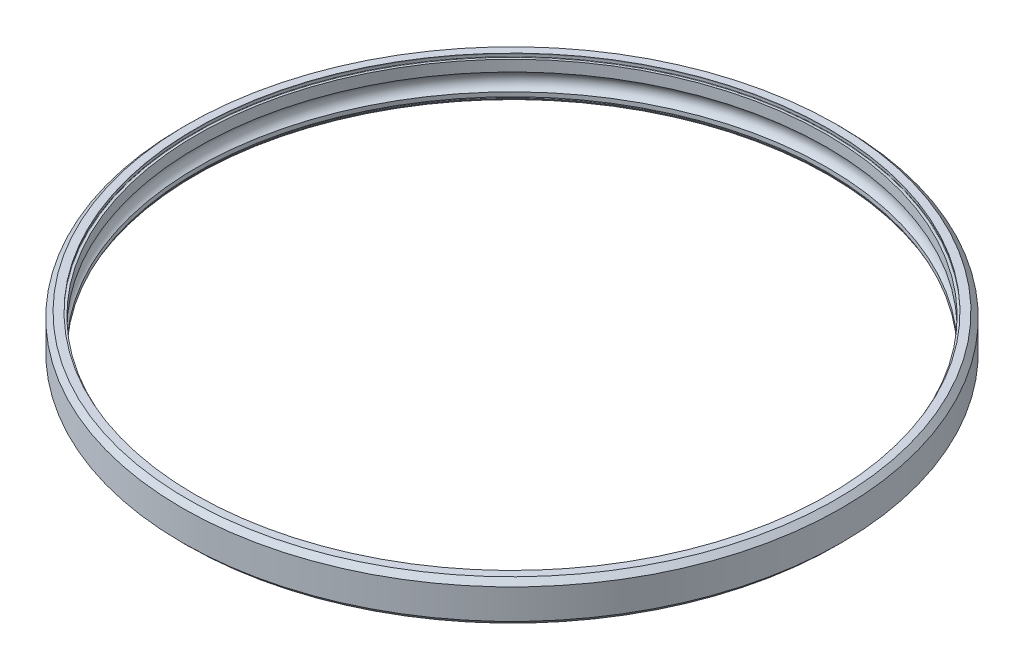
ISO-10303-21;
HEADER;
FILE_DESCRIPTION(('STEP AP214'),'2;1');
FILE_NAME('part.step','',(''),(''),'','','');
FILE_SCHEMA(('AUTOMOTIVE_DESIGN { 1 0 10303 214 1 1 1 1 }'));
ENDSEC;
DATA;
#1=APPLICATION_CONTEXT('core data for automotive mechanical design processes');
#2=APPLICATION_PROTOCOL_DEFINITION('international standard','automotive_design',2000,#1);
#3=PRODUCT_CONTEXT('',#1,'mechanical');
#4=PRODUCT('Part','Part','',(#3));
#5=PRODUCT_RELATED_PRODUCT_CATEGORY('part','',(#4));
#6=PRODUCT_DEFINITION_FORMATION('','',#4);
#7=PRODUCT_DEFINITION_CONTEXT('part definition',#1,'design');
#8=PRODUCT_DEFINITION('design','',#6,#7);
#9=PRODUCT_DEFINITION_SHAPE('','',#8);
#10=(LENGTH_UNIT() NAMED_UNIT(*) SI_UNIT(.MILLI.,.METRE.));
#11=(NAMED_UNIT(*) PLANE_ANGLE_UNIT() SI_UNIT($,.RADIAN.));
#12=(NAMED_UNIT(*) SI_UNIT($,.STERADIAN.) SOLID_ANGLE_UNIT());
#13=UNCERTAINTY_MEASURE_WITH_UNIT(LENGTH_MEASURE(1.E-05),#10,'distance_accuracy_value','');
#14=(GEOMETRIC_REPRESENTATION_CONTEXT(3) GLOBAL_UNCERTAINTY_ASSIGNED_CONTEXT((#13)) GLOBAL_UNIT_ASSIGNED_CONTEXT((#10,
#11,#12)) REPRESENTATION_CONTEXT('',''));
#15=CARTESIAN_POINT('',(0.,0.,0.));
#16=DIRECTION('',(0.,0.,1.));
#17=DIRECTION('',(1.,0.,0.));
#18=AXIS2_PLACEMENT_3D('',#15,#16,#17);
#19=CARTESIAN_POINT('',(0.,0.,0.));
#20=DIRECTION('',(0.,-1.,0.));
#21=DIRECTION('',(0.,0.,-1.));
#22=AXIS2_PLACEMENT_3D('',#19,#20,#21);
#23=CYLINDRICAL_SURFACE('',#22,62.1411);
#24=CARTESIAN_POINT('',(0.,-1.70000731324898,0.));
#25=DIRECTION('',(0.,-1.,0.));
#26=DIRECTION('',(0.,0.,-1.));
#27=AXIS2_PLACEMENT_3D('',#24,#25,#26);
#28=CIRCLE('',#27,62.1411);
#29=CARTESIAN_POINT('',(0.,-1.70000731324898,-62.1411));
#30=VERTEX_POINT('',#29);
#31=EDGE_CURVE('E48',#30,#30,#28,.T.);
#32=ORIENTED_EDGE('',*,*,#31,.F.);
#33=EDGE_LOOP('',(#32));
#34=FACE_BOUND('',#33,.T.);
#35=CARTESIAN_POINT('',(0.,-2.53237999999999,0.));
#36=DIRECTION('',(0.,-1.,0.));
#37=DIRECTION('',(0.,0.,-1.));
#38=AXIS2_PLACEMENT_3D('',#35,#36,#37);
#39=CIRCLE('',#38,62.1411);
#40=CARTESIAN_POINT('',(0.,-2.53237999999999,-62.1411));
#41=VERTEX_POINT('',#40);
#42=EDGE_CURVE('E75',#41,#41,#39,.T.);
#43=ORIENTED_EDGE('',*,*,#42,.T.);
#44=EDGE_LOOP('',(#43));
#45=FACE_BOUND('',#44,.T.);
#46=ADVANCED_FACE('F28',(#34,#45),#23,.F.);
#47=CARTESIAN_POINT('',(-62.1411,-3.29438000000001,0.));
#48=DIRECTION('',(0.,1.,0.));
#49=DIRECTION('',(0.,0.,1.));
#50=AXIS2_PLACEMENT_3D('',#47,#48,#49);
#51=PLANE('',#50);
#52=CARTESIAN_POINT('',(0.,-3.29438000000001,0.));
#53=DIRECTION('',(0.,1.,0.));
#54=DIRECTION('',(0.,0.,1.));
#55=AXIS2_PLACEMENT_3D('',#52,#53,#54);
#56=CIRCLE('',#55,64.0715);
#57=CARTESIAN_POINT('',(0.,-3.29438000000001,64.0715));
#58=VERTEX_POINT('',#57);
#59=EDGE_CURVE('E10',#58,#58,#56,.F.);
#60=ORIENTED_EDGE('',*,*,#59,.T.);
#61=EDGE_LOOP('',(#60));
#62=FACE_BOUND('',#61,.T.);
#63=CARTESIAN_POINT('',(0.,-3.29437999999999,0.));
#64=DIRECTION('',(0.,-1.,0.));
#65=DIRECTION('',(0.,0.,-1.));
#66=AXIS2_PLACEMENT_3D('',#63,#64,#65);
#67=CIRCLE('',#66,62.54115);
#68=CARTESIAN_POINT('',(0.,-3.29437999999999,-62.54115));
#69=VERTEX_POINT('',#68);
#70=EDGE_CURVE('E93',#69,#69,#67,.T.);
#71=ORIENTED_EDGE('',*,*,#70,.F.);
#72=EDGE_LOOP('',(#71));
#73=FACE_BOUND('',#72,.T.);
#74=ADVANCED_FACE('F99',(#62,#73),#51,.F.);
#75=CARTESIAN_POINT('',(0.,1.70000731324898,0.));
#76=DIRECTION('',(0.,-1.,0.));
#77=DIRECTION('',(0.,0.,-1.));
#78=AXIS2_PLACEMENT_3D('',#75,#76,#77);
#79=CIRCLE('',#78,62.1411);
#80=CARTESIAN_POINT('',(0.,1.70000731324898,-62.1411));
#81=VERTEX_POINT('',#80);
#82=EDGE_CURVE('E51',#81,#81,#79,.T.);
#83=ORIENTED_EDGE('',*,*,#82,.T.);
#84=EDGE_LOOP('',(#83));
#85=FACE_BOUND('',#84,.T.);
#86=CARTESIAN_POINT('',(0.,3.88111999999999,0.));
#87=DIRECTION('',(0.,-1.,0.));
#88=DIRECTION('',(0.,0.,-1.));
#89=AXIS2_PLACEMENT_3D('',#86,#87,#88);
#90=CIRCLE('',#89,62.1411);
#91=CARTESIAN_POINT('',(0.,3.88111999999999,-62.1411));
#92=VERTEX_POINT('',#91);
#93=EDGE_CURVE('E54',#92,#92,#90,.T.);
#94=ORIENTED_EDGE('',*,*,#93,.F.);
#95=EDGE_LOOP('',(#94));
#96=FACE_BOUND('',#95,.T.);
#97=ADVANCED_FACE('F101',(#85,#96),#23,.F.);
#98=CARTESIAN_POINT('',(-62.1411,4.64311999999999,0.));
#99=DIRECTION('',(0.,-1.,0.));
#100=DIRECTION('',(0.,0.,-1.));
#101=AXIS2_PLACEMENT_3D('',#98,#99,#100);
#102=PLANE('',#101);
#103=CARTESIAN_POINT('',(0.,4.64311999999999,0.));
#104=DIRECTION('',(0.,-1.,0.));
#105=DIRECTION('',(0.,0.,-1.));
#106=AXIS2_PLACEMENT_3D('',#103,#104,#105);
#107=CIRCLE('',#106,64.0715);
#108=CARTESIAN_POINT('',(0.,4.64311999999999,-64.0715));
#109=VERTEX_POINT('',#108);
#110=EDGE_CURVE('E35',#109,#109,#107,.F.);
#111=ORIENTED_EDGE('',*,*,#110,.T.);
#112=EDGE_LOOP('',(#111));
#113=FACE_BOUND('',#112,.T.);
#114=CARTESIAN_POINT('',(0.,4.64311999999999,0.));
#115=DIRECTION('',(0.,-1.,0.));
#116=DIRECTION('',(0.,0.,-1.));
#117=AXIS2_PLACEMENT_3D('',#114,#115,#116);
#118=CIRCLE('',#117,62.54115);
#119=CARTESIAN_POINT('',(0.,4.64311999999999,-62.54115));
#120=VERTEX_POINT('',#119);
#121=EDGE_CURVE('E72',#120,#120,#118,.T.);
#122=ORIENTED_EDGE('',*,*,#121,.T.);
#123=EDGE_LOOP('',(#122));
#124=FACE_BOUND('',#123,.T.);
#125=ADVANCED_FACE('F106',(#113,#124),#102,.F.);
#126=CARTESIAN_POINT('',(0.,0.,0.));
#127=DIRECTION('',(0.,-1.,0.));
#128=DIRECTION('',(0.,0.,-1.));
#129=AXIS2_PLACEMENT_3D('',#126,#127,#128);
#130=CYLINDRICAL_SURFACE('',#129,65.0875);
#131=CARTESIAN_POINT('',(0.,3.62711999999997,0.));
#132=DIRECTION('',(0.,-1.,0.));
#133=DIRECTION('',(0.,0.,-1.));
#134=AXIS2_PLACEMENT_3D('',#131,#132,#133);
#135=CIRCLE('',#134,65.0875);
#136=CARTESIAN_POINT('',(0.,3.62711999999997,-65.0875));
#137=VERTEX_POINT('',#136);
#138=EDGE_CURVE('E39',#137,#137,#135,.T.);
#139=ORIENTED_EDGE('',*,*,#138,.T.);
#140=EDGE_LOOP('',(#139));
#141=FACE_BOUND('',#140,.T.);
#142=CARTESIAN_POINT('',(0.,-2.27838000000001,0.));
#143=DIRECTION('',(0.,1.,0.));
#144=DIRECTION('',(0.,0.,1.));
#145=AXIS2_PLACEMENT_3D('',#142,#143,#144);
#146=CIRCLE('',#145,65.0875);
#147=CARTESIAN_POINT('',(0.,-2.27838000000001,65.0875));
#148=VERTEX_POINT('',#147);
#149=EDGE_CURVE('E43',#148,#148,#146,.T.);
#150=ORIENTED_EDGE('',*,*,#149,.T.);
#151=EDGE_LOOP('',(#150));
#152=FACE_BOUND('',#151,.T.);
#153=ADVANCED_FACE('F30',(#141,#152),#130,.T.);
#154=CARTESIAN_POINT('',(0.,0.,0.));
#155=DIRECTION('',(0.,-1.,0.));
#156=DIRECTION('',(0.,0.,-1.));
#157=AXIS2_PLACEMENT_3D('',#154,#155,#156);
#158=TOROIDAL_SURFACE('',#157,61.11875,1.98374000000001);
#159=ORIENTED_EDGE('',*,*,#31,.T.);
#160=EDGE_LOOP('',(#159));
#161=FACE_BOUND('',#160,.T.);
#162=ORIENTED_EDGE('',*,*,#82,.F.);
#163=EDGE_LOOP('',(#162));
#164=FACE_BOUND('',#163,.T.);
#165=ADVANCED_FACE('F113',(#161,#164),#158,.F.);
#166=CARTESIAN_POINT('',(0.,3.62711999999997,0.));
#167=DIRECTION('',(0.,-1.,0.));
#168=DIRECTION('',(0.,0.,-1.));
#169=AXIS2_PLACEMENT_3D('',#166,#167,#168);
#170=CONICAL_SURFACE('',#169,65.0875,0.785398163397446);
#171=ORIENTED_EDGE('',*,*,#110,.F.);
#172=EDGE_LOOP('',(#171));
#173=FACE_BOUND('',#172,.T.);
#174=ORIENTED_EDGE('',*,*,#138,.F.);
#175=EDGE_LOOP('',(#174));
#176=FACE_BOUND('',#175,.T.);
#177=ADVANCED_FACE('F116',(#173,#176),#170,.T.);
#178=CARTESIAN_POINT('',(0.,-3.29438000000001,0.));
#179=DIRECTION('',(0.,1.,0.));
#180=DIRECTION('',(0.,0.,1.));
#181=AXIS2_PLACEMENT_3D('',#178,#179,#180);
#182=CONICAL_SURFACE('',#181,64.0715,0.785398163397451);
#183=ORIENTED_EDGE('',*,*,#149,.F.);
#184=EDGE_LOOP('',(#183));
#185=FACE_BOUND('',#184,.T.);
#186=ORIENTED_EDGE('',*,*,#59,.F.);
#187=EDGE_LOOP('',(#186));
#188=FACE_BOUND('',#187,.T.);
#189=ADVANCED_FACE('F120',(#185,#188),#182,.T.);
#190=CARTESIAN_POINT('',(-62.1411,3.88111999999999,0.));
#191=DIRECTION('',(0.,1.,0.));
#192=DIRECTION('',(0.,0.,1.));
#193=AXIS2_PLACEMENT_3D('',#190,#191,#192);
#194=PLANE('',#193);
#195=ORIENTED_EDGE('',*,*,#93,.T.);
#196=EDGE_LOOP('',(#195));
#197=FACE_BOUND('',#196,.T.);
#198=CARTESIAN_POINT('',(0.,3.88111999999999,0.));
#199=DIRECTION('',(0.,-1.,0.));
#200=DIRECTION('',(0.,0.,-1.));
#201=AXIS2_PLACEMENT_3D('',#198,#199,#200);
#202=CIRCLE('',#201,62.5983);
#203=CARTESIAN_POINT('',(0.,3.88111999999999,-62.5983));
#204=VERTEX_POINT('',#203);
#205=EDGE_CURVE('E57',#204,#204,#202,.T.);
#206=ORIENTED_EDGE('',*,*,#205,.F.);
#207=EDGE_LOOP('',(#206));
#208=FACE_BOUND('',#207,.T.);
#209=ADVANCED_FACE('F124',(#197,#208),#194,.T.);
#210=CARTESIAN_POINT('',(0.,3.95731999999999,0.));
#211=DIRECTION('',(0.,-1.,0.));
#212=DIRECTION('',(0.,0.,-1.));
#213=AXIS2_PLACEMENT_3D('',#210,#211,#212);
#214=TOROIDAL_SURFACE('',#213,62.5983,0.0761999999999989);
#215=ORIENTED_EDGE('',*,*,#205,.T.);
#216=EDGE_LOOP('',(#215));
#217=FACE_BOUND('',#216,.T.);
#218=CARTESIAN_POINT('',(0.,3.95731999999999,0.));
#219=DIRECTION('',(0.,-1.,0.));
#220=DIRECTION('',(0.,0.,-1.));
#221=AXIS2_PLACEMENT_3D('',#218,#219,#220);
#222=CIRCLE('',#221,62.6745);
#223=CARTESIAN_POINT('',(0.,3.95731999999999,-62.6745));
#224=VERTEX_POINT('',#223);
#225=EDGE_CURVE('E60',#224,#224,#222,.T.);
#226=ORIENTED_EDGE('',*,*,#225,.F.);
#227=EDGE_LOOP('',(#226));
#228=FACE_BOUND('',#227,.T.);
#229=ADVANCED_FACE('F128',(#217,#228),#214,.F.);
#230=CARTESIAN_POINT('',(0.,0.,0.));
#231=DIRECTION('',(0.,-1.,0.));
#232=DIRECTION('',(0.,0.,-1.));
#233=AXIS2_PLACEMENT_3D('',#230,#231,#232);
#234=CYLINDRICAL_SURFACE('',#233,62.6745);
#235=ORIENTED_EDGE('',*,*,#225,.T.);
#236=EDGE_LOOP('',(#235));
#237=FACE_BOUND('',#236,.T.);
#238=CARTESIAN_POINT('',(0.,4.43991999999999,0.));
#239=DIRECTION('',(0.,-1.,0.));
#240=DIRECTION('',(0.,0.,-1.));
#241=AXIS2_PLACEMENT_3D('',#238,#239,#240);
#242=CIRCLE('',#241,62.6745);
#243=CARTESIAN_POINT('',(0.,4.43991999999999,-62.6745));
#244=VERTEX_POINT('',#243);
#245=EDGE_CURVE('E63',#244,#244,#242,.T.);
#246=ORIENTED_EDGE('',*,*,#245,.F.);
#247=EDGE_LOOP('',(#246));
#248=FACE_BOUND('',#247,.T.);
#249=ADVANCED_FACE('F132',(#237,#248),#234,.F.);
#250=CARTESIAN_POINT('',(0.,4.43991999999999,0.));
#251=DIRECTION('',(0.,-1.,0.));
#252=DIRECTION('',(0.,0.,-1.));
#253=AXIS2_PLACEMENT_3D('',#250,#251,#252);
#254=TOROIDAL_SURFACE('',#253,62.5983,0.0761999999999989);
#255=ORIENTED_EDGE('',*,*,#245,.T.);
#256=EDGE_LOOP('',(#255));
#257=FACE_BOUND('',#256,.T.);
#258=CARTESIAN_POINT('',(0.,4.51611999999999,0.));
#259=DIRECTION('',(0.,-1.,0.));
#260=DIRECTION('',(0.,0.,-1.));
#261=AXIS2_PLACEMENT_3D('',#258,#259,#260);
#262=CIRCLE('',#261,62.5983);
#263=CARTESIAN_POINT('',(0.,4.51611999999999,-62.5983));
#264=VERTEX_POINT('',#263);
#265=EDGE_CURVE('E66',#264,#264,#262,.T.);
#266=ORIENTED_EDGE('',*,*,#265,.F.);
#267=EDGE_LOOP('',(#266));
#268=FACE_BOUND('',#267,.T.);
#269=ADVANCED_FACE('F136',(#257,#268),#254,.F.);
#270=CARTESIAN_POINT('',(-62.54115,4.51611999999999,0.));
#271=DIRECTION('',(0.,-1.,0.));
#272=DIRECTION('',(0.,0.,-1.));
#273=AXIS2_PLACEMENT_3D('',#270,#271,#272);
#274=PLANE('',#273);
#275=ORIENTED_EDGE('',*,*,#265,.T.);
#276=EDGE_LOOP('',(#275));
#277=FACE_BOUND('',#276,.T.);
#278=CARTESIAN_POINT('',(0.,4.51611999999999,0.));
#279=DIRECTION('',(0.,-1.,0.));
#280=DIRECTION('',(0.,0.,-1.));
#281=AXIS2_PLACEMENT_3D('',#278,#279,#280);
#282=CIRCLE('',#281,62.54115);
#283=CARTESIAN_POINT('',(0.,4.51611999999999,-62.54115));
#284=VERTEX_POINT('',#283);
#285=EDGE_CURVE('E69',#284,#284,#282,.T.);
#286=ORIENTED_EDGE('',*,*,#285,.F.);
#287=EDGE_LOOP('',(#286));
#288=FACE_BOUND('',#287,.T.);
#289=ADVANCED_FACE('F140',(#277,#288),#274,.T.);
#290=CARTESIAN_POINT('',(0.,0.,0.));
#291=DIRECTION('',(0.,-1.,0.));
#292=DIRECTION('',(0.,0.,-1.));
#293=AXIS2_PLACEMENT_3D('',#290,#291,#292);
#294=CYLINDRICAL_SURFACE('',#293,62.54115);
#295=ORIENTED_EDGE('',*,*,#285,.T.);
#296=EDGE_LOOP('',(#295));
#297=FACE_BOUND('',#296,.T.);
#298=ORIENTED_EDGE('',*,*,#121,.F.);
#299=EDGE_LOOP('',(#298));
#300=FACE_BOUND('',#299,.T.);
#301=ADVANCED_FACE('F144',(#297,#300),#294,.F.);
#302=CARTESIAN_POINT('',(-62.1411,-2.53237999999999,0.));
#303=DIRECTION('',(0.,-1.,0.));
#304=DIRECTION('',(0.,0.,1.));
#305=AXIS2_PLACEMENT_3D('',#302,#303,#304);
#306=PLANE('',#305);
#307=ORIENTED_EDGE('',*,*,#42,.F.);
#308=EDGE_LOOP('',(#307));
#309=FACE_BOUND('',#308,.T.);
#310=CARTESIAN_POINT('',(0.,-2.53237999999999,0.));
#311=DIRECTION('',(0.,-1.,0.));
#312=DIRECTION('',(0.,0.,-1.));
#313=AXIS2_PLACEMENT_3D('',#310,#311,#312);
#314=CIRCLE('',#313,62.5983);
#315=CARTESIAN_POINT('',(0.,-2.53237999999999,-62.5983));
#316=VERTEX_POINT('',#315);
#317=EDGE_CURVE('E78',#316,#316,#314,.T.);
#318=ORIENTED_EDGE('',*,*,#317,.T.);
#319=EDGE_LOOP('',(#318));
#320=FACE_BOUND('',#319,.T.);
#321=ADVANCED_FACE('F148',(#309,#320),#306,.T.);
#322=CARTESIAN_POINT('',(0.,-2.60857999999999,0.));
#323=DIRECTION('',(0.,1.,0.));
#324=DIRECTION('',(0.,0.,-1.));
#325=AXIS2_PLACEMENT_3D('',#322,#323,#324);
#326=TOROIDAL_SURFACE('',#325,62.5983,0.0761999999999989);
#327=ORIENTED_EDGE('',*,*,#317,.F.);
#328=EDGE_LOOP('',(#327));
#329=FACE_BOUND('',#328,.T.);
#330=CARTESIAN_POINT('',(0.,-2.60857999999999,0.));
#331=DIRECTION('',(0.,-1.,0.));
#332=DIRECTION('',(0.,0.,-1.));
#333=AXIS2_PLACEMENT_3D('',#330,#331,#332);
#334=CIRCLE('',#333,62.6745);
#335=CARTESIAN_POINT('',(0.,-2.60857999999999,-62.6745));
#336=VERTEX_POINT('',#335);
#337=EDGE_CURVE('E81',#336,#336,#334,.T.);
#338=ORIENTED_EDGE('',*,*,#337,.T.);
#339=EDGE_LOOP('',(#338));
#340=FACE_BOUND('',#339,.T.);
#341=ADVANCED_FACE('F152',(#329,#340),#326,.F.);
#342=CARTESIAN_POINT('',(0.,1.34874,0.));
#343=DIRECTION('',(0.,1.,0.));
#344=DIRECTION('',(0.,0.,-1.));
#345=AXIS2_PLACEMENT_3D('',#342,#343,#344);
#346=CYLINDRICAL_SURFACE('',#345,62.6745);
#347=ORIENTED_EDGE('',*,*,#337,.F.);
#348=EDGE_LOOP('',(#347));
#349=FACE_BOUND('',#348,.T.);
#350=CARTESIAN_POINT('',(0.,-3.09117999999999,0.));
#351=DIRECTION('',(0.,-1.,0.));
#352=DIRECTION('',(0.,0.,-1.));
#353=AXIS2_PLACEMENT_3D('',#350,#351,#352);
#354=CIRCLE('',#353,62.6745);
#355=CARTESIAN_POINT('',(0.,-3.09117999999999,-62.6745));
#356=VERTEX_POINT('',#355);
#357=EDGE_CURVE('E84',#356,#356,#354,.T.);
#358=ORIENTED_EDGE('',*,*,#357,.T.);
#359=EDGE_LOOP('',(#358));
#360=FACE_BOUND('',#359,.T.);
#361=ADVANCED_FACE('F156',(#349,#360),#346,.F.);
#362=CARTESIAN_POINT('',(0.,-3.09117999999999,0.));
#363=DIRECTION('',(0.,1.,0.));
#364=DIRECTION('',(0.,0.,-1.));
#365=AXIS2_PLACEMENT_3D('',#362,#363,#364);
#366=TOROIDAL_SURFACE('',#365,62.5983,0.0761999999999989);
#367=ORIENTED_EDGE('',*,*,#357,.F.);
#368=EDGE_LOOP('',(#367));
#369=FACE_BOUND('',#368,.T.);
#370=CARTESIAN_POINT('',(0.,-3.16737999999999,0.));
#371=DIRECTION('',(0.,-1.,0.));
#372=DIRECTION('',(0.,0.,-1.));
#373=AXIS2_PLACEMENT_3D('',#370,#371,#372);
#374=CIRCLE('',#373,62.5983);
#375=CARTESIAN_POINT('',(0.,-3.16737999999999,-62.5983));
#376=VERTEX_POINT('',#375);
#377=EDGE_CURVE('E87',#376,#376,#374,.T.);
#378=ORIENTED_EDGE('',*,*,#377,.T.);
#379=EDGE_LOOP('',(#378));
#380=FACE_BOUND('',#379,.T.);
#381=ADVANCED_FACE('F160',(#369,#380),#366,.F.);
#382=CARTESIAN_POINT('',(-62.54115,-3.16737999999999,0.));
#383=DIRECTION('',(0.,1.,0.));
#384=DIRECTION('',(0.,0.,-1.));
#385=AXIS2_PLACEMENT_3D('',#382,#383,#384);
#386=PLANE('',#385);
#387=ORIENTED_EDGE('',*,*,#377,.F.);
#388=EDGE_LOOP('',(#387));
#389=FACE_BOUND('',#388,.T.);
#390=CARTESIAN_POINT('',(0.,-3.16737999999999,0.));
#391=DIRECTION('',(0.,-1.,0.));
#392=DIRECTION('',(0.,0.,-1.));
#393=AXIS2_PLACEMENT_3D('',#390,#391,#392);
#394=CIRCLE('',#393,62.54115);
#395=CARTESIAN_POINT('',(0.,-3.16737999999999,-62.54115));
#396=VERTEX_POINT('',#395);
#397=EDGE_CURVE('E90',#396,#396,#394,.T.);
#398=ORIENTED_EDGE('',*,*,#397,.T.);
#399=EDGE_LOOP('',(#398));
#400=FACE_BOUND('',#399,.T.);
#401=ADVANCED_FACE('F164',(#389,#400),#386,.T.);
#402=CARTESIAN_POINT('',(0.,1.34874,0.));
#403=DIRECTION('',(0.,1.,0.));
#404=DIRECTION('',(0.,0.,-1.));
#405=AXIS2_PLACEMENT_3D('',#402,#403,#404);
#406=CYLINDRICAL_SURFACE('',#405,62.54115);
#407=ORIENTED_EDGE('',*,*,#397,.F.);
#408=EDGE_LOOP('',(#407));
#409=FACE_BOUND('',#408,.T.);
#410=ORIENTED_EDGE('',*,*,#70,.T.);
#411=EDGE_LOOP('',(#410));
#412=FACE_BOUND('',#411,.T.);
#413=ADVANCED_FACE('F97',(#409,#412),#406,.F.);
#414=CLOSED_SHELL('',(#46,#74,#97,#125,#153,#165,#177,#189,#209,#229,#249,#269,#289,#301,#321,
#341,#361,#381,#401,#413));
#415=MANIFOLD_SOLID_BREP('B2',#414);
#416=ADVANCED_BREP_SHAPE_REPRESENTATION('',(#18,#415),#14);
#417=SHAPE_DEFINITION_REPRESENTATION(#9,#416);
ENDSEC;
END-ISO-10303-21;
